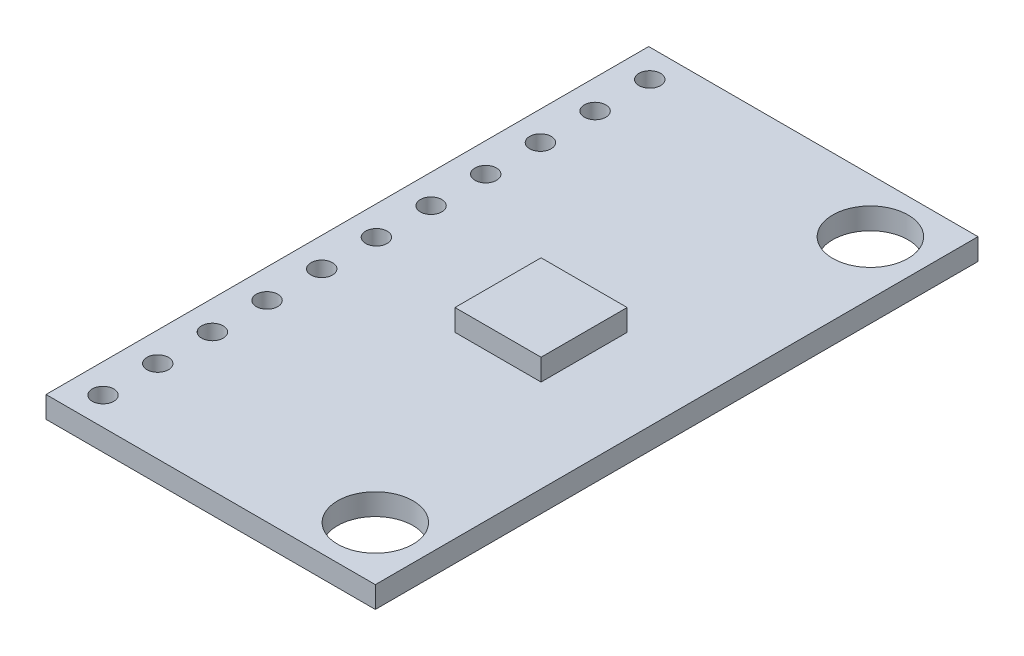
from build123d import *

# Parameters (mm, degrees)
SKETCH1_W           = 15.3
SKETCH1_H           = 28
SKETCH1_R           = 1.75
SKETCH1_R_2         = 0.5
BOSS_EXTRUDE1_DEPTH = 1
SKETCH2_W           = 4
SKETCH2_H           = 4
BOSS_EXTRUDE2_DEPTH = 1


with BuildPart() as part:
    # Sketch1 → Boss-Extrude1 (new body)
    with BuildSketch(Plane(origin=(0, 0, 0), x_dir=(1, 0, 0), z_dir=(0, 1, 0))):
        with Locations((-1.35, 0)):
            Rectangle(SKETCH1_W, SKETCH1_H)
        with Locations(Location((3.8, 11.5, 0), (0, 0, 270))):
            Circle(SKETCH1_R, mode=Mode.SUBTRACT)
        with Locations(Location((3.8, -11.5, 0), (0, 0, 90))):
            Circle(SKETCH1_R, mode=Mode.SUBTRACT)
        with Locations(Location((-7.65, 0, 0), (0, 0, 270))):
            Circle(SKETCH1_R_2, mode=Mode.SUBTRACT)
        with Locations(Location((-7.65, 2.54, 0), (0, 0, 270))):
            Circle(SKETCH1_R_2, mode=Mode.SUBTRACT)
        with Locations(Location((-7.65, 5.08, 0), (0, 0, 270))):
            Circle(SKETCH1_R_2, mode=Mode.SUBTRACT)
        with Locations(Location((-7.65, 7.62, 0), (0, 0, 270))):
            Circle(SKETCH1_R_2, mode=Mode.SUBTRACT)
        with Locations(Location((-7.65, 10.16, 0), (0, 0, 270))):
            Circle(SKETCH1_R_2, mode=Mode.SUBTRACT)
        with Locations(Location((-7.65, 12.7, 0), (0, 0, 270))):
            Circle(SKETCH1_R_2, mode=Mode.SUBTRACT)
        with Locations(Location((-7.65, -12.7, 0), (0, 0, 90))):
            Circle(SKETCH1_R_2, mode=Mode.SUBTRACT)
        with Locations(Location((-7.65, -10.16, 0), (0, 0, 90))):
            Circle(SKETCH1_R_2, mode=Mode.SUBTRACT)
        with Locations(Location((-7.65, -7.62, 0), (0, 0, 90))):
            Circle(SKETCH1_R_2, mode=Mode.SUBTRACT)
        with Locations(Location((-7.65, -5.08, 0), (0, 0, 90))):
            Circle(SKETCH1_R_2, mode=Mode.SUBTRACT)
        with Locations(Location((-7.65, -2.54, 0), (0, 0, 90))):
            Circle(SKETCH1_R_2, mode=Mode.SUBTRACT)
    extrude(amount=BOSS_EXTRUDE1_DEPTH)

    # Sketch2 → Boss-Extrude2 (add)
    with BuildSketch(Plane(origin=(0, 1, 0), x_dir=(1, 0, 0), z_dir=(0, 1, 0))):
        Rectangle(SKETCH2_W, SKETCH2_H)
    extrude(amount=BOSS_EXTRUDE2_DEPTH)


solid = part.part
